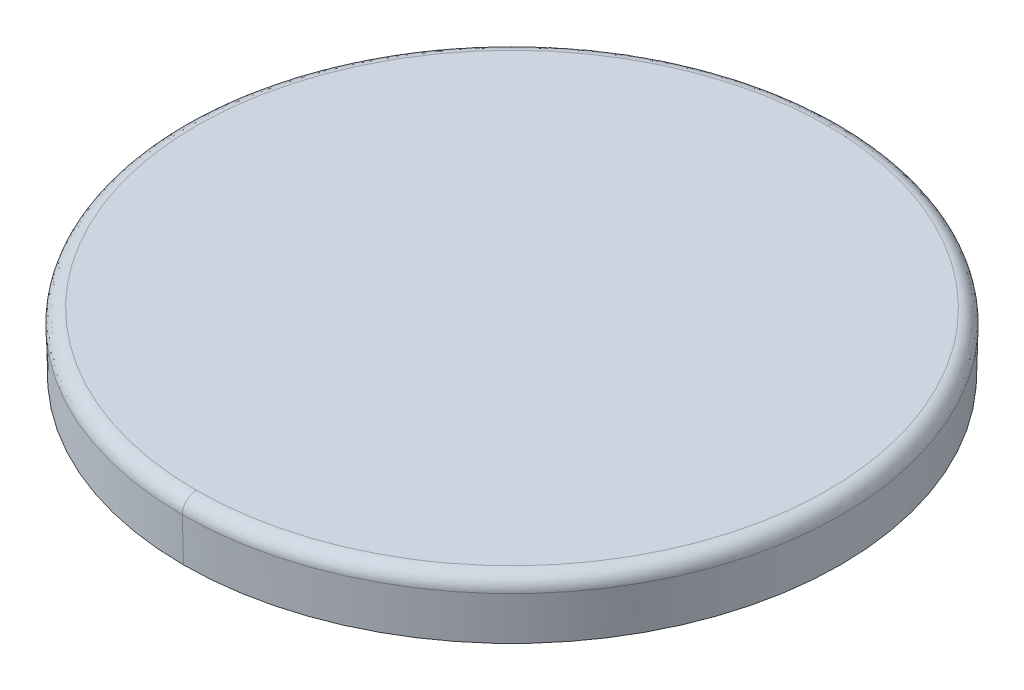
ISO-10303-21;
HEADER;
FILE_DESCRIPTION(('STEP AP214'),'2;1');
FILE_NAME('part.step','',(''),(''),'','','');
FILE_SCHEMA(('AUTOMOTIVE_DESIGN { 1 0 10303 214 1 1 1 1 }'));
ENDSEC;
DATA;
#1=APPLICATION_CONTEXT('core data for automotive mechanical design processes');
#2=APPLICATION_PROTOCOL_DEFINITION('international standard','automotive_design',2000,#1);
#3=PRODUCT_CONTEXT('',#1,'mechanical');
#4=PRODUCT('Part','Part','',(#3));
#5=PRODUCT_RELATED_PRODUCT_CATEGORY('part','',(#4));
#6=PRODUCT_DEFINITION_FORMATION('','',#4);
#7=PRODUCT_DEFINITION_CONTEXT('part definition',#1,'design');
#8=PRODUCT_DEFINITION('design','',#6,#7);
#9=PRODUCT_DEFINITION_SHAPE('','',#8);
#10=(LENGTH_UNIT() NAMED_UNIT(*) SI_UNIT(.MILLI.,.METRE.));
#11=(NAMED_UNIT(*) PLANE_ANGLE_UNIT() SI_UNIT($,.RADIAN.));
#12=(NAMED_UNIT(*) SI_UNIT($,.STERADIAN.) SOLID_ANGLE_UNIT());
#13=UNCERTAINTY_MEASURE_WITH_UNIT(LENGTH_MEASURE(1.E-05),#10,'distance_accuracy_value','');
#14=(GEOMETRIC_REPRESENTATION_CONTEXT(3) GLOBAL_UNCERTAINTY_ASSIGNED_CONTEXT((#13)) GLOBAL_UNIT_ASSIGNED_CONTEXT((#10,
#11,#12)) REPRESENTATION_CONTEXT('',''));
#15=CARTESIAN_POINT('',(0.,0.,0.));
#16=DIRECTION('',(0.,0.,1.));
#17=DIRECTION('',(1.,0.,0.));
#18=AXIS2_PLACEMENT_3D('',#15,#16,#17);
#19=CARTESIAN_POINT('',(-14.6,13.2498470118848,7.36542035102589));
#20=CARTESIAN_POINT('',(-1.06915929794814,13.2498470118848,7.36542035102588));
#21=CARTESIAN_POINT('',(-1.06915929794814,13.2498470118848,-6.16542035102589));
#22=CARTESIAN_POINT('',(-14.6,13.2498470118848,-6.16542035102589));
#23=CARTESIAN_POINT('',(-14.6,13.2558690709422,7.55391333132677));
#24=CARTESIAN_POINT('',(-0.692173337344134,13.2558690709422,7.55391333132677));
#25=CARTESIAN_POINT('',(-0.692173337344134,13.2558690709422,-6.35391333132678));
#26=CARTESIAN_POINT('',(-14.6,13.2558690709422,-6.35391333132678));
#27=CARTESIAN_POINT('',(-14.6,13.1207662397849,7.68548336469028));
#28=CARTESIAN_POINT('',(-0.429033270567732,13.1207662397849,7.68548336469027));
#29=CARTESIAN_POINT('',(-0.429033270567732,13.1207662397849,-6.48548336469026));
#30=CARTESIAN_POINT('',(-14.6,13.1207662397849,-6.48548336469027));
#31=CARTESIAN_POINT('',(-14.6,12.9325106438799,7.67448976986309));
#32=CARTESIAN_POINT('',(-0.451020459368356,12.9325106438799,7.67448976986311));
#33=CARTESIAN_POINT('',(-0.451020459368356,12.9325106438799,-6.4744897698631));
#34=CARTESIAN_POINT('',(-14.6,12.9325106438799,-6.47448976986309));
#35=(BOUNDED_SURFACE() B_SPLINE_SURFACE(3,3,((#19,#20,#21,#22),(#23,#24,#25,#26),(#27,#28,#29,
#30),(#31,#32,#33,#34)),.UNSPECIFIED.,.F.,.F.,.F.) B_SPLINE_SURFACE_WITH_KNOTS((4,4),(4,4),
(0.0428134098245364,0.957411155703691),(0.,1.),
.UNSPECIFIED.) GEOMETRIC_REPRESENTATION_ITEM() RATIONAL_B_SPLINE_SURFACE(((0.969088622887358,
0.323029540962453,0.323029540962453,0.969088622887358),(0.758820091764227,0.252940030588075,
0.252940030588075,0.758820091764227),(0.758871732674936,0.252957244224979,0.252957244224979,
0.758871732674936),(0.969243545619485,0.323081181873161,0.323081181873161,0.969243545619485))) REPRESENTATION_ITEM('') SURFACE());
#36=CARTESIAN_POINT('',(-14.6,12.942191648,0.6));
#37=DIRECTION('',(0.,1.,0.));
#38=DIRECTION('',(0.,0.,1.));
#39=AXIS2_PLACEMENT_3D('',#36,#37,#38);
#40=CIRCLE('',#39,7.074898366);
#41=CARTESIAN_POINT('',(-14.6,12.9421916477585,7.67489836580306));
#42=VERTEX_POINT('',#41);
#43=CARTESIAN_POINT('',(-14.6000000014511,12.9421916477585,-6.47489836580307));
#44=VERTEX_POINT('',#43);
#45=EDGE_CURVE('E83',#42,#44,#40,.T.);
#46=CARTESIAN_POINT('',(-14.6000000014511,12.9421916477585,-6.47489836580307));
#47=CARTESIAN_POINT('',(-14.6,13.1215156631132,-6.47956736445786));
#48=CARTESIAN_POINT('',(-14.6,13.2499999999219,-6.35438478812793));
#49=CARTESIAN_POINT('',(-14.6,13.2500000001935,-6.17499999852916));
#50=(BOUNDED_CURVE() B_SPLINE_CURVE(3,(#46,#47,#48,#49),.UNSPECIFIED.,.F.,
.F.) B_SPLINE_CURVE_WITH_KNOTS((4,4),(0.0624574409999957,0.937542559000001),
.UNSPECIFIED.) CURVE() GEOMETRIC_REPRESENTATION_ITEM() RATIONAL_B_SPLINE_CURVE((0.955831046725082,
0.76329091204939,0.76329091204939,0.95583104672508)) REPRESENTATION_ITEM(''));
#51=CARTESIAN_POINT('',(-14.6,13.2500000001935,-6.17499999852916));
#52=VERTEX_POINT('',#51);
#53=EDGE_CURVE('E91',#44,#52,#50,.T.);
#54=CARTESIAN_POINT('',(-14.6,13.2500000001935,7.37499999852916));
#55=CARTESIAN_POINT('',(-14.4495298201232,13.25,7.37499999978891));
#56=CARTESIAN_POINT('',(-14.2242601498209,13.25,7.36750553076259));
#57=CARTESIAN_POINT('',(-13.9622078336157,13.25,7.34564666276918));
#58=CARTESIAN_POINT('',(-13.8313722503,13.25,7.33143839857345));
#59=CARTESIAN_POINT('',(-13.7660021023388,13.25,7.32351455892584));
#60=CARTESIAN_POINT('',(-13.7379965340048,13.25,7.31994297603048));
#61=CARTESIAN_POINT('',(-13.7193284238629,13.25,7.31752288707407));
#62=CARTESIAN_POINT('',(-13.7112115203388,13.25,7.31645609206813));
#63=CARTESIAN_POINT('',(-13.5318988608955,13.25,7.29245473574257));
#64=CARTESIAN_POINT('',(-13.2806172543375,13.25,7.24913207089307));
#65=CARTESIAN_POINT('',(-12.9907203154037,13.25,7.18207176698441));
#66=CARTESIAN_POINT('',(-12.8465880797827,13.25,7.14441231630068));
#67=CARTESIAN_POINT('',(-12.7747260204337,13.25,7.12455026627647));
#68=CARTESIAN_POINT('',(-12.7439717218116,13.25,7.1158167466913));
#69=CARTESIAN_POINT('',(-12.7234785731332,13.25,7.10994524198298));
#70=CARTESIAN_POINT('',(-12.7145220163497,13.25,7.10735964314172));
#71=CARTESIAN_POINT('',(-12.5186477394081,13.25,7.05024570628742));
#72=CARTESIAN_POINT('',(-12.2464060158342,13.25,6.95816594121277));
#73=CARTESIAN_POINT('',(-11.936292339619,13.25,6.83070498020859));
#74=CARTESIAN_POINT('',(-11.7831109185,13.25,6.76196585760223));
#75=CARTESIAN_POINT('',(-11.7069890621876,13.25,6.72634413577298));
#76=CARTESIAN_POINT('',(-11.6744658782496,13.25,6.71080936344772));
#77=CARTESIAN_POINT('',(-11.6528060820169,13.25,6.7003932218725));
#78=CARTESIAN_POINT('',(-11.6432537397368,13.25,6.69577258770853));
#79=CARTESIAN_POINT('',(-11.4379963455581,13.25,6.59572848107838));
#80=CARTESIAN_POINT('',(-11.1560863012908,13.25,6.44137315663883));
#81=CARTESIAN_POINT('',(-10.8409551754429,13.25,6.23833791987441));
#82=CARTESIAN_POINT('',(-10.6868305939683,13.25,6.13108179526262));
#83=CARTESIAN_POINT('',(-10.6106285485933,13.25,6.07601910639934));
#84=CARTESIAN_POINT('',(-10.5781548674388,13.25,6.05211339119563));
#85=CARTESIAN_POINT('',(-10.5565467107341,13.25,6.03610793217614));
#86=CARTESIAN_POINT('',(-10.5468779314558,13.25,6.02890702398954));
#87=CARTESIAN_POINT('',(-10.3449530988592,13.25,5.8774876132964));
#88=CARTESIAN_POINT('',(-10.0724864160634,13.25,5.6499526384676));
#89=CARTESIAN_POINT('',(-9.7766650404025,13.25,5.36040397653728));
#90=CARTESIAN_POINT('',(-9.6342684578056,13.25,5.20960684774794));
#91=CARTESIAN_POINT('',(-9.56444869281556,13.25,5.13270258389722));
#92=CARTESIAN_POINT('',(-9.5348213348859,13.25,5.09942096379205));
#93=CARTESIAN_POINT('',(-9.51513540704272,13.25,5.07716151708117));
#94=CARTESIAN_POINT('',(-9.50614839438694,13.25,5.06693896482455));
#95=CARTESIAN_POINT('',(-9.32594076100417,13.25,4.86048340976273));
#96=CARTESIAN_POINT('',(-9.08954923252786,13.25,4.55643017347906));
#97=CARTESIAN_POINT('',(-8.84529280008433,13.25,4.17967489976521));
#98=CARTESIAN_POINT('',(-8.73104800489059,13.25,3.98579063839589));
#99=CARTESIAN_POINT('',(-8.68377525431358,13.25,3.90151739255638));
#100=CARTESIAN_POINT('',(-8.65263548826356,13.25,3.8450730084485));
#101=CARTESIAN_POINT('',(-8.63815293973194,13.25,3.81840620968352));
#102=CARTESIAN_POINT('',(-8.49330589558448,13.25,3.54686796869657));
#103=CARTESIAN_POINT('',(-8.32316653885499,13.25,3.17577460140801));
#104=CARTESIAN_POINT('',(-8.16490318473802,13.25,2.72700817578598));
#105=CARTESIAN_POINT('',(-8.10569729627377,13.25,2.53128881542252));
#106=CARTESIAN_POINT('',(-8.0681425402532,13.25,2.40005571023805));
#107=CARTESIAN_POINT('',(-8.05068173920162,13.25,2.33547413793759));
#108=CARTESIAN_POINT('',(-7.96458073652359,13.25,1.99656498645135));
#109=CARTESIAN_POINT('',(-7.91284994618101,13.25,1.72330866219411));
#110=CARTESIAN_POINT('',(-7.84259752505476,13.25,1.16385087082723));
#111=CARTESIAN_POINT('',(-7.82502288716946,13.25,0.881925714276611));
#112=CARTESIAN_POINT('',(-7.82498855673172,13.25,0.459037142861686));
#113=CARTESIAN_POINT('',(-7.82937647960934,13.25,0.31825740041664));
#114=CARTESIAN_POINT('',(-7.84695105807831,13.25,0.0370641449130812));
#115=CARTESIAN_POINT('',(-7.8603192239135,13.25,-0.104796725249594));
#116=CARTESIAN_POINT('',(-7.89512824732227,13.25,-0.382362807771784));
#117=CARTESIAN_POINT('',(-7.92764885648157,13.25,-0.589464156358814));
#118=CARTESIAN_POINT('',(-7.96979022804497,13.25,-0.794955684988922));
#119=CARTESIAN_POINT('',(-8.00002242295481,13.25,-0.931592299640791));
#120=CARTESIAN_POINT('',(-8.01663232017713,13.25,-1.00140505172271));
#121=CARTESIAN_POINT('',(-8.10077841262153,13.25,-1.33284133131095));
#122=CARTESIAN_POINT('',(-8.22484072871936,13.25,-1.72177097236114));
#123=CARTESIAN_POINT('',(-8.40998235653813,13.25,-2.16013290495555));
#124=CARTESIAN_POINT('',(-8.51265373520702,13.25,-2.3754665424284));
#125=CARTESIAN_POINT('',(-8.55882016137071,13.25,-2.46692795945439));
#126=CARTESIAN_POINT('',(-8.59007875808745,13.25,-2.52771903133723));
#127=CARTESIAN_POINT('',(-8.60688915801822,13.25,-2.55978693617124));
#128=CARTESIAN_POINT('',(-8.74341614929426,13.25,-2.81582215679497));
#129=CARTESIAN_POINT('',(-8.94362028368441,13.25,-3.14483220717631));
#130=CARTESIAN_POINT('',(-9.20898602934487,13.25,-3.50702933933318));
#131=CARTESIAN_POINT('',(-9.34961746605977,13.25,-3.68271592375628));
#132=CARTESIAN_POINT('',(-9.42192032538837,13.25,-3.769206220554));
#133=CARTESIAN_POINT('',(-9.45333308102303,13.25,-3.80598356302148));
#134=CARTESIAN_POINT('',(-9.47436954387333,13.25,-3.8304373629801));
#135=CARTESIAN_POINT('',(-9.48578669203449,13.25,-3.8436079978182));
#136=CARTESIAN_POINT('',(-9.65172799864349,13.25,-4.03377888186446));
#137=CARTESIAN_POINT('',(-9.89879454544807,13.25,-4.2886678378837));
#138=CARTESIAN_POINT('',(-10.2094326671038,13.25,-4.56226001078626));
#139=CARTESIAN_POINT('',(-10.3703501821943,13.25,-4.69311152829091));
#140=CARTESIAN_POINT('',(-10.4522085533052,13.25,-4.75705114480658));
#141=CARTESIAN_POINT('',(-10.4875906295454,13.25,-4.78413537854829));
#142=CARTESIAN_POINT('',(-10.5112453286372,13.25,-4.80212076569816));
#143=CARTESIAN_POINT('',(-10.5242551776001,13.25,-4.81194009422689));
#144=CARTESIAN_POINT('',(-10.706917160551,13.25,-4.9489584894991));
#145=CARTESIAN_POINT('',(-10.9728775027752,13.25,-5.12941331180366));
#146=CARTESIAN_POINT('',(-11.2973126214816,13.25,-5.31722384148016));
#147=CARTESIAN_POINT('',(-11.4630671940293,13.25,-5.40544908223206));
#148=CARTESIAN_POINT('',(-11.5468287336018,13.25,-5.44814169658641));
#149=CARTESIAN_POINT('',(-11.5829160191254,13.25,-5.46613424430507));
#150=CARTESIAN_POINT('',(-11.6070163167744,13.25,-5.47806165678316));
#151=CARTESIAN_POINT('',(-11.6203920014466,13.25,-5.48462760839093));
#152=CARTESIAN_POINT('',(-11.8037841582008,13.25,-5.57404815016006));
#153=CARTESIAN_POINT('',(-12.0672149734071,13.25,-5.68893257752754));
#154=CARTESIAN_POINT('',(-12.3824683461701,13.25,-5.8030908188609));
#155=CARTESIAN_POINT('',(-12.5420743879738,13.25,-5.85520154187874));
#156=CARTESIAN_POINT('',(-12.6223722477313,13.25,-5.88001480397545));
#157=CARTESIAN_POINT('',(-12.6568916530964,13.25,-5.890382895));
#158=CARTESIAN_POINT('',(-12.6799281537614,13.25,-5.89723580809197));
#159=CARTESIAN_POINT('',(-12.6927840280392,13.25,-5.90101950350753));
#160=CARTESIAN_POINT('',(-12.8664555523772,13.25,-5.95168794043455));
#161=CARTESIAN_POINT('',(-13.1137551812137,13.25,-6.01383442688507));
#162=CARTESIAN_POINT('',(-13.405974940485,13.25,-6.06991416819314));
#163=CARTESIAN_POINT('',(-13.5530107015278,13.25,-6.09384791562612));
#164=CARTESIAN_POINT('',(-13.6267600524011,13.25,-6.10478825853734));
#165=CARTESIAN_POINT('',(-13.6584165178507,13.25,-6.10925700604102));
#166=CARTESIAN_POINT('',(-13.6795318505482,13.25,-6.11218728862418));
#167=CARTESIAN_POINT('',(-13.691342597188,13.25,-6.11379516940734));
#168=CARTESIAN_POINT('',(-13.9989395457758,13.25,-6.15501474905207));
#169=CARTESIAN_POINT('',(-14.2987183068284,13.25,-6.17499999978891));
#170=CARTESIAN_POINT('',(-14.6,13.2500000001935,-6.17499999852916));
#171=(BOUNDED_CURVE() B_SPLINE_CURVE(3,(#54,#55,#56,#57,#58,#59,#60,#61,#62,#63,#64,#65,#66,#67,
#68,#69,#70,#71,#72,#73,#74,#75,#76,#77,#78,#79,#80,#81,#82,#83,#84,#85,#86,#87,#88,#89,#90,#91,
#92,#93,#94,#95,#96,#97,#98,#99,#100,#101,#102,#103,#104,#105,#106,#107,#108,#109,#110,#111,
#112,#113,#114,#115,#116,#117,#118,#119,#120,#121,#122,#123,#124,#125,#126,#127,#128,#129,#130,
#131,#132,#133,#134,#135,#136,#137,#138,#139,#140,#141,#142,#143,#144,#145,#146,#147,#148,#149,
#150,#151,#152,#153,#154,#155,#156,#157,#158,#159,#160,#161,#162,#163,#164,#165,#166,#167,#168,
#169,#170),.UNSPECIFIED.,.F.,.F.) B_SPLINE_CURVE_WITH_KNOTS((4,1,1,1,1,2,2,1,1,1,1,2,2,1,1,1,1,
2,2,1,1,1,1,2,2,1,1,1,1,2,2,1,1,1,2,2,1,1,2,2,2,2,2,2,1,2,2,1,1,1,2,2,1,1,1,1,2,2,1,1,1,1,2,2,1,
1,1,1,2,2,1,1,1,1,2,2,1,1,1,1,2,2,4),(0.,0.0312499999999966,0.0468749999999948,
0.0546874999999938,0.0585937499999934,0.0605468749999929,0.0624999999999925,0.0937499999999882,
0.109374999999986,0.117187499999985,0.121093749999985,0.123046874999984,0.124999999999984,
0.156249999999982,0.171874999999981,0.179687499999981,0.183593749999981,0.185546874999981,
0.187499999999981,0.21874999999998,0.23437499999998,0.24218749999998,0.24609374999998,
0.24804687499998,0.24999999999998,0.28124999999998,0.296874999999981,0.304687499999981,
0.308593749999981,0.310546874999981,0.312499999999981,0.34374999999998,0.35937499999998,
0.36718749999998,0.37109374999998,0.374999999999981,0.406249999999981,0.421874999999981,
0.429687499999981,0.437499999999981,0.468749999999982,0.5,0.515624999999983,0.531249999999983,
0.546874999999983,0.554687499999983,0.562499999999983,0.593749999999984,0.609374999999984,
0.617187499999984,0.621093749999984,0.624999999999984,0.656249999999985,0.671874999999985,
0.679687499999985,0.683593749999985,0.685546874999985,0.687499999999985,0.718749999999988,
0.73437499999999,0.742187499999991,0.746093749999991,0.748046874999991,0.749999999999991,
0.78125,0.796875,0.8046875,0.808593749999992,0.810546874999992,0.8125,0.84375,0.859375,
0.8671875,0.871093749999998,0.873046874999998,0.875,0.90625,0.921875,0.9296875,0.93359375,
0.935546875,0.9375,1.),
.UNSPECIFIED.) CURVE() GEOMETRIC_REPRESENTATION_ITEM() RATIONAL_B_SPLINE_CURVE((1.,1.,1.,1.,1.,
1.,1.,1.,1.,1.,1.,1.,1.,1.,1.,1.,1.,1.,1.,1.,1.,1.,1.,1.,1.,1.,1.,1.,1.,1.,1.,1.,1.,1.,1.,1.,1.,
1.,1.,1.,1.,1.,1.,1.,1.,1.,1.,1.,1.,1.,1.,1.,1.,1.,1.,1.,1.,1.,1.,1.,1.,1.,1.,1.,1.,1.,1.,1.,1.,
1.,1.,1.,1.,1.,1.,1.,1.,1.,1.,1.,1.,1.,1.,1.,1.,1.,1.,1.,1.,1.,1.,1.,1.,1.,1.,1.,1.,1.,1.,1.,1.,
1.,1.,1.,1.,1.,1.,1.,1.,1.,1.,1.,1.,1.,1.,1.,1.)) REPRESENTATION_ITEM(''));
#172=CARTESIAN_POINT('',(-14.6,13.2500000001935,7.37499999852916));
#173=VERTEX_POINT('',#172);
#174=EDGE_CURVE('E10',#173,#52,#171,.T.);
#175=CARTESIAN_POINT('',(-14.6,13.2500000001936,7.37499999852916));
#176=CARTESIAN_POINT('',(-14.6,13.2499999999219,7.55438478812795));
#177=CARTESIAN_POINT('',(-14.6,13.1215156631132,7.67956736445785));
#178=CARTESIAN_POINT('',(-14.6,12.9421916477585,7.67489836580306));
#179=(BOUNDED_CURVE() B_SPLINE_CURVE(3,(#175,#176,#177,#178),.UNSPECIFIED.,.F.,
.F.) B_SPLINE_CURVE_WITH_KNOTS((4,4),(0.0624574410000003,0.937542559),
.UNSPECIFIED.) CURVE() GEOMETRIC_REPRESENTATION_ITEM() RATIONAL_B_SPLINE_CURVE((0.955831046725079,
0.76329091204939,0.763290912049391,0.955831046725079)) REPRESENTATION_ITEM(''));
#180=EDGE_CURVE('E20',#173,#42,#179,.T.);
#181=ORIENTED_EDGE('',*,*,#45,.T.);
#182=ORIENTED_EDGE('',*,*,#53,.T.);
#183=ORIENTED_EDGE('',*,*,#174,.F.);
#184=ORIENTED_EDGE('',*,*,#180,.T.);
#185=EDGE_LOOP('',(#181,#182,#183,#184));
#186=FACE_BOUND('',#185,.T.);
#187=ADVANCED_FACE('F15',(#186),#35,.T.);
#188=CARTESIAN_POINT('',(-21.4563,13.25,-6.2563));
#189=DIRECTION('',(0.,1.,0.));
#190=DIRECTION('',(1.,0.,0.));
#191=AXIS2_PLACEMENT_3D('',#188,#189,#190);
#192=PLANE('',#191);
#193=CARTESIAN_POINT('',(-14.6,13.2500000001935,7.37499999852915));
#194=CARTESIAN_POINT('',(-28.1499999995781,13.2500000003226,7.37499999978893));
#195=CARTESIAN_POINT('',(-28.1499999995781,13.2500000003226,-6.17499999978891));
#196=CARTESIAN_POINT('',(-14.6,13.2500000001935,-6.17499999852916));
#197=(BOUNDED_CURVE() B_SPLINE_CURVE(3,(#193,#194,#195,#196),.UNSPECIFIED.,.F.,
.F.) B_SPLINE_CURVE_WITH_KNOTS((4,4),(0.,1.),
.UNSPECIFIED.) CURVE() GEOMETRIC_REPRESENTATION_ITEM() RATIONAL_B_SPLINE_CURVE((0.955831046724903,
0.3186103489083,0.3186103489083,0.955831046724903)) REPRESENTATION_ITEM(''));
#198=EDGE_CURVE('E28',#173,#52,#197,.T.);
#199=ORIENTED_EDGE('',*,*,#198,.F.);
#200=ORIENTED_EDGE('',*,*,#174,.T.);
#201=EDGE_LOOP('',(#199,#200));
#202=FACE_BOUND('',#201,.T.);
#203=ADVANCED_FACE('F121',(#202),#192,.T.);
#204=CARTESIAN_POINT('',(-21.734971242,12.,7.734971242));
#205=DIRECTION('',(0.,-1.,0.));
#206=DIRECTION('',(0.,0.,-1.));
#207=AXIS2_PLACEMENT_3D('',#204,#205,#206);
#208=PLANE('',#207);
#209=CARTESIAN_POINT('',(-14.6,12.,0.6));
#210=DIRECTION('',(0.,-1.,0.));
#211=DIRECTION('',(0.,0.,1.));
#212=AXIS2_PLACEMENT_3D('',#209,#210,#211);
#213=CIRCLE('',#212,7.05036684);
#214=CARTESIAN_POINT('',(-14.6,12.,7.65036684));
#215=VERTEX_POINT('',#214);
#216=CARTESIAN_POINT('',(-14.6,12.,-6.45036684));
#217=VERTEX_POINT('',#216);
#218=EDGE_CURVE('E62',#215,#217,#213,.T.);
#219=ORIENTED_EDGE('',*,*,#218,.T.);
#220=CARTESIAN_POINT('',(-14.6,12.,0.6));
#221=DIRECTION('',(0.,-1.,0.));
#222=DIRECTION('',(0.,0.,1.));
#223=AXIS2_PLACEMENT_3D('',#220,#221,#222);
#224=CIRCLE('',#223,7.05036684);
#225=EDGE_CURVE('E66',#217,#215,#224,.T.);
#226=ORIENTED_EDGE('',*,*,#225,.T.);
#227=EDGE_LOOP('',(#219,#226));
#228=FACE_BOUND('',#227,.T.);
#229=ADVANCED_FACE('F64',(#228),#208,.T.);
#230=CARTESIAN_POINT('',(-14.6,13.2499988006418,-6.17415158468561));
#231=CARTESIAN_POINT('',(-28.1483031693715,13.2499988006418,-6.17415158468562));
#232=CARTESIAN_POINT('',(-28.1483031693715,13.2499988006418,7.37415158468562));
#233=CARTESIAN_POINT('',(-14.6,13.2499988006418,7.37415158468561));
#234=CARTESIAN_POINT('',(-14.6,13.2505216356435,-6.35902570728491));
#235=CARTESIAN_POINT('',(-28.5180514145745,13.2505216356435,-6.35902570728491));
#236=CARTESIAN_POINT('',(-28.5180514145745,13.2505216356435,7.55902570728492));
#237=CARTESIAN_POINT('',(-14.6,13.2505216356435,7.55902570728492));
#238=CARTESIAN_POINT('',(-14.6,13.1160818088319,-6.48520980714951));
#239=CARTESIAN_POINT('',(-28.770419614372,13.1160818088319,-6.48520980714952));
#240=CARTESIAN_POINT('',(-28.770419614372,13.1160818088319,7.68520980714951));
#241=CARTESIAN_POINT('',(-14.6,13.1160818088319,7.68520980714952));
#242=CARTESIAN_POINT('',(-14.6,12.9325106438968,-6.47448976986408));
#243=CARTESIAN_POINT('',(-28.7489795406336,12.9325106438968,-6.47448976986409));
#244=CARTESIAN_POINT('',(-28.7489795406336,12.9325106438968,7.67448976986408));
#245=CARTESIAN_POINT('',(-14.6,12.9325106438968,7.67448976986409));
#246=(BOUNDED_SURFACE() B_SPLINE_SURFACE(3,3,((#230,#231,#232,#233),(#234,#235,#236,#237),(#238,
#239,#240,#241),(#242,#243,#244,#245)),.UNSPECIFIED.,.F.,.F.,
.F.) B_SPLINE_SURFACE_WITH_KNOTS((4,4),(4,4),(0.0607288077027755,0.957411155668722),(0.,1.),
.UNSPECIFIED.) GEOMETRIC_REPRESENTATION_ITEM() RATIONAL_B_SPLINE_SURFACE(((0.956974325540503,
0.318991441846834,0.318991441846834,0.956974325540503),(0.758902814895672,0.252967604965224,
0.252967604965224,0.758902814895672),(0.762992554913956,0.254330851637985,0.254330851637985,
0.762992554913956),(0.969243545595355,0.323081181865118,0.323081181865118,0.969243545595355))) REPRESENTATION_ITEM('') SURFACE());
#247=CARTESIAN_POINT('',(-14.6,12.942191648,0.6));
#248=DIRECTION('',(0.,1.,0.));
#249=DIRECTION('',(0.,0.,1.));
#250=AXIS2_PLACEMENT_3D('',#247,#248,#249);
#251=CIRCLE('',#250,7.074898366);
#252=EDGE_CURVE('E71',#44,#42,#251,.T.);
#253=ORIENTED_EDGE('',*,*,#53,.F.);
#254=ORIENTED_EDGE('',*,*,#252,.T.);
#255=ORIENTED_EDGE('',*,*,#180,.F.);
#256=ORIENTED_EDGE('',*,*,#198,.T.);
#257=EDGE_LOOP('',(#253,#254,#255,#256));
#258=FACE_BOUND('',#257,.T.);
#259=ADVANCED_FACE('F120',(#258),#246,.T.);
#260=CARTESIAN_POINT('',(-14.6,12.,0.6));
#261=DIRECTION('',(0.,1.,0.));
#262=DIRECTION('',(0.,0.,1.));
#263=AXIS2_PLACEMENT_3D('',#260,#261,#262);
#264=CONICAL_SURFACE('',#263,7.05036684,0.0260307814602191);
#265=DIRECTION('',(0.,0.999661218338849,-0.0260278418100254));
#266=VECTOR('',#265,1.);
#267=CARTESIAN_POINT('',(-14.6,12.,-6.45036684));
#268=LINE('',#267,#266);
#269=EDGE_CURVE('E76',#217,#44,#268,.T.);
#270=ORIENTED_EDGE('',*,*,#269,.F.);
#271=ORIENTED_EDGE('',*,*,#218,.F.);
#272=DIRECTION('',(0.,0.999661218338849,0.0260278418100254));
#273=VECTOR('',#272,1.);
#274=CARTESIAN_POINT('',(-14.6,12.,7.65036684));
#275=LINE('',#274,#273);
#276=EDGE_CURVE('E72',#215,#42,#275,.T.);
#277=ORIENTED_EDGE('',*,*,#276,.T.);
#278=ORIENTED_EDGE('',*,*,#252,.F.);
#279=EDGE_LOOP('',(#270,#271,#277,#278));
#280=FACE_BOUND('',#279,.T.);
#281=ADVANCED_FACE('F77',(#280),#264,.T.);
#282=CARTESIAN_POINT('',(-14.6,12.,0.6));
#283=DIRECTION('',(0.,1.,0.));
#284=DIRECTION('',(0.,0.,1.));
#285=AXIS2_PLACEMENT_3D('',#282,#283,#284);
#286=CONICAL_SURFACE('',#285,7.05036684,0.0260307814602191);
#287=ORIENTED_EDGE('',*,*,#225,.F.);
#288=ORIENTED_EDGE('',*,*,#269,.T.);
#289=ORIENTED_EDGE('',*,*,#45,.F.);
#290=ORIENTED_EDGE('',*,*,#276,.F.);
#291=EDGE_LOOP('',(#287,#288,#289,#290));
#292=FACE_BOUND('',#291,.T.);
#293=ADVANCED_FACE('F85',(#292),#286,.T.);
#294=CLOSED_SHELL('',(#187,#203,#229,#259,#281,#293));
#295=MANIFOLD_SOLID_BREP('B1',#294);
#296=ADVANCED_BREP_SHAPE_REPRESENTATION('',(#18,#295),#14);
#297=SHAPE_DEFINITION_REPRESENTATION(#9,#296);
ENDSEC;
END-ISO-10303-21;
